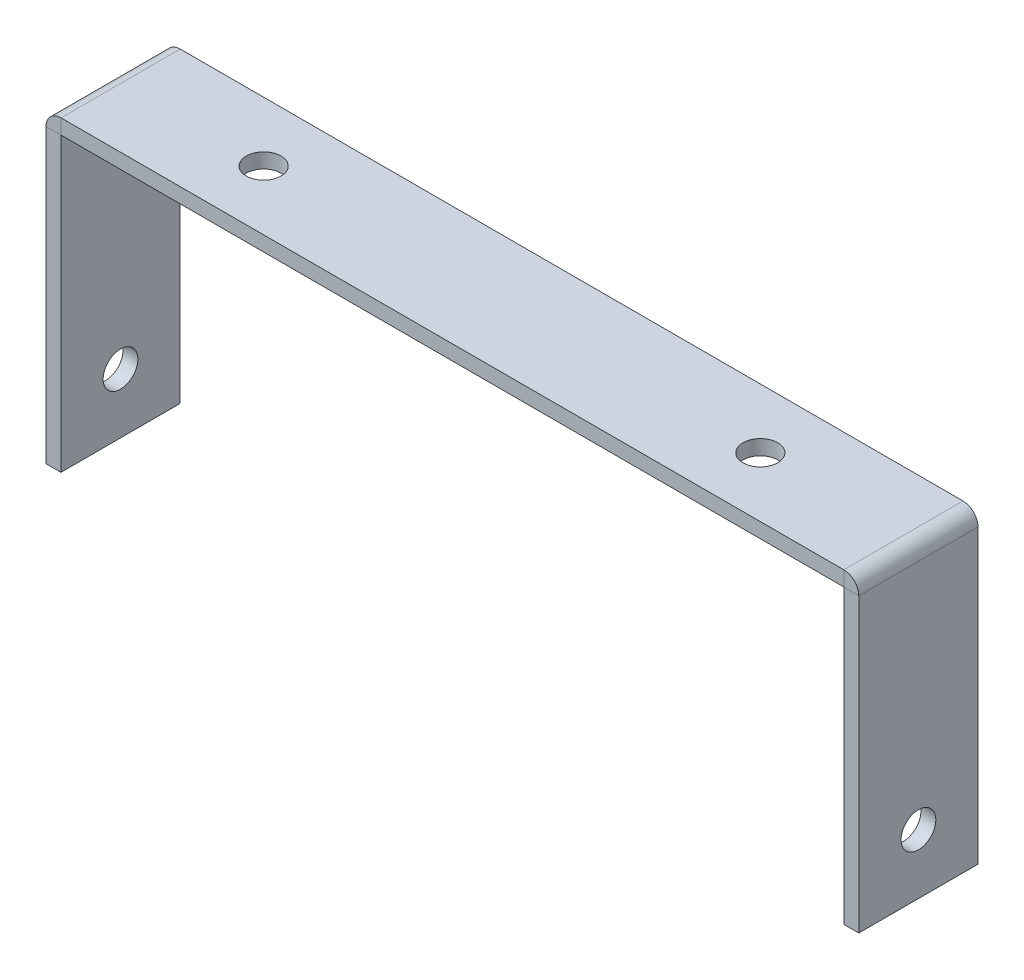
ISO-10303-21;
HEADER;
FILE_DESCRIPTION(('STEP AP214'),'2;1');
FILE_NAME('part.step','',(''),(''),'','','');
FILE_SCHEMA(('AUTOMOTIVE_DESIGN { 1 0 10303 214 1 1 1 1 }'));
ENDSEC;
DATA;
#1=APPLICATION_CONTEXT('core data for automotive mechanical design processes');
#2=APPLICATION_PROTOCOL_DEFINITION('international standard','automotive_design',2000,#1);
#3=PRODUCT_CONTEXT('',#1,'mechanical');
#4=PRODUCT('Part','Part','',(#3));
#5=PRODUCT_RELATED_PRODUCT_CATEGORY('part','',(#4));
#6=PRODUCT_DEFINITION_FORMATION('','',#4);
#7=PRODUCT_DEFINITION_CONTEXT('part definition',#1,'design');
#8=PRODUCT_DEFINITION('design','',#6,#7);
#9=PRODUCT_DEFINITION_SHAPE('','',#8);
#10=(LENGTH_UNIT() NAMED_UNIT(*) SI_UNIT(.MILLI.,.METRE.));
#11=(NAMED_UNIT(*) PLANE_ANGLE_UNIT() SI_UNIT($,.RADIAN.));
#12=(NAMED_UNIT(*) SI_UNIT($,.STERADIAN.) SOLID_ANGLE_UNIT());
#13=UNCERTAINTY_MEASURE_WITH_UNIT(LENGTH_MEASURE(1.E-05),#10,'distance_accuracy_value','');
#14=(GEOMETRIC_REPRESENTATION_CONTEXT(3) GLOBAL_UNCERTAINTY_ASSIGNED_CONTEXT((#13)) GLOBAL_UNIT_ASSIGNED_CONTEXT((#10,
#11,#12)) REPRESENTATION_CONTEXT('',''));
#15=CARTESIAN_POINT('',(0.,0.,0.));
#16=DIRECTION('',(0.,0.,1.));
#17=DIRECTION('',(1.,0.,0.));
#18=AXIS2_PLACEMENT_3D('',#15,#16,#17);
#19=CARTESIAN_POINT('',(70.,0.,-12.));
#20=DIRECTION('',(0.,-1.,0.));
#21=DIRECTION('',(0.,0.,-1.));
#22=AXIS2_PLACEMENT_3D('',#19,#20,#21);
#23=PLANE('',#22);
#24=CARTESIAN_POINT('',(25.,0.,-6.));
#25=DIRECTION('',(0.,1.,0.));
#26=DIRECTION('',(0.,0.,1.));
#27=AXIS2_PLACEMENT_3D('',#24,#25,#26);
#28=CIRCLE('',#27,1.75);
#29=CARTESIAN_POINT('',(25.,0.,-4.25));
#30=VERTEX_POINT('',#29);
#31=EDGE_CURVE('E234',#30,#30,#28,.T.);
#32=ORIENTED_EDGE('',*,*,#31,.T.);
#33=EDGE_LOOP('',(#32));
#34=FACE_BOUND('',#33,.T.);
#35=CARTESIAN_POINT('',(-25.,0.,-6.));
#36=DIRECTION('',(0.,1.,0.));
#37=DIRECTION('',(0.,0.,-1.));
#38=AXIS2_PLACEMENT_3D('',#35,#36,#37);
#39=CIRCLE('',#38,1.75);
#40=CARTESIAN_POINT('',(-25.,0.,-7.75));
#41=VERTEX_POINT('',#40);
#42=EDGE_CURVE('E228',#41,#41,#39,.T.);
#43=ORIENTED_EDGE('',*,*,#42,.T.);
#44=EDGE_LOOP('',(#43));
#45=FACE_BOUND('',#44,.T.);
#46=DIRECTION('',(1.,0.,0.));
#47=VECTOR('',#46,1.);
#48=CARTESIAN_POINT('',(-70.,0.,0.));
#49=LINE('',#48,#47);
#50=CARTESIAN_POINT('',(-39.4030973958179,0.,0.));
#51=VERTEX_POINT('',#50);
#52=CARTESIAN_POINT('',(39.4030973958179,2.75818942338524E-08,0.));
#53=VERTEX_POINT('',#52);
#54=EDGE_CURVE('E57',#51,#53,#49,.T.);
#55=ORIENTED_EDGE('',*,*,#54,.F.);
#56=DIRECTION('',(0.,0.,-1.));
#57=VECTOR('',#56,1.);
#58=CARTESIAN_POINT('',(-39.4030973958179,0.,-12.));
#59=LINE('',#58,#57);
#60=CARTESIAN_POINT('',(-39.4030973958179,0.,-12.));
#61=VERTEX_POINT('',#60);
#62=EDGE_CURVE('E49',#51,#61,#59,.T.);
#63=ORIENTED_EDGE('',*,*,#62,.T.);
#64=DIRECTION('',(-1.,0.,0.));
#65=VECTOR('',#64,1.);
#66=CARTESIAN_POINT('',(-70.,0.,-12.));
#67=LINE('',#66,#65);
#68=CARTESIAN_POINT('',(39.4030973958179,0.,-12.));
#69=VERTEX_POINT('',#68);
#70=EDGE_CURVE('E65',#69,#61,#67,.T.);
#71=ORIENTED_EDGE('',*,*,#70,.F.);
#72=DIRECTION('',(0.,0.,-1.));
#73=VECTOR('',#72,1.);
#74=CARTESIAN_POINT('',(39.4030973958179,0.,-12.));
#75=LINE('',#74,#73);
#76=EDGE_CURVE('E246',#53,#69,#75,.T.);
#77=ORIENTED_EDGE('',*,*,#76,.F.);
#78=EDGE_LOOP('',(#55,#63,#71,#77));
#79=FACE_BOUND('',#78,.T.);
#80=ADVANCED_FACE('F40',(#34,#45,#79),#23,.T.);
#81=CARTESIAN_POINT('',(-70.,1.5,0.));
#82=DIRECTION('',(0.,0.,-1.));
#83=DIRECTION('',(-1.,0.,0.));
#84=AXIS2_PLACEMENT_3D('',#81,#82,#83);
#85=PLANE('',#84);
#86=DIRECTION('',(0.,1.,0.));
#87=VECTOR('',#86,1.);
#88=CARTESIAN_POINT('',(-39.4030973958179,1.5,0.));
#89=LINE('',#88,#87);
#90=CARTESIAN_POINT('',(-39.4030973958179,1.50000001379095,0.));
#91=VERTEX_POINT('',#90);
#92=EDGE_CURVE('E12',#51,#91,#89,.T.);
#93=ORIENTED_EDGE('',*,*,#92,.F.);
#94=ORIENTED_EDGE('',*,*,#54,.T.);
#95=DIRECTION('',(0.,1.,0.));
#96=VECTOR('',#95,1.);
#97=CARTESIAN_POINT('',(39.4030973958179,1.5,0.));
#98=LINE('',#97,#96);
#99=CARTESIAN_POINT('',(39.4030973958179,1.50000001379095,0.));
#100=VERTEX_POINT('',#99);
#101=EDGE_CURVE('E243',#53,#100,#98,.T.);
#102=ORIENTED_EDGE('',*,*,#101,.T.);
#103=DIRECTION('',(1.,0.,0.));
#104=VECTOR('',#103,1.);
#105=CARTESIAN_POINT('',(-70.,1.5,0.));
#106=LINE('',#105,#104);
#107=EDGE_CURVE('E44',#91,#100,#106,.T.);
#108=ORIENTED_EDGE('',*,*,#107,.F.);
#109=EDGE_LOOP('',(#93,#94,#102,#108));
#110=FACE_BOUND('',#109,.T.);
#111=ADVANCED_FACE('F42',(#110),#85,.F.);
#112=CARTESIAN_POINT('',(-70.,1.5,-12.));
#113=DIRECTION('',(0.,0.,1.));
#114=DIRECTION('',(1.,0.,0.));
#115=AXIS2_PLACEMENT_3D('',#112,#113,#114);
#116=PLANE('',#115);
#117=DIRECTION('',(0.,-1.,0.));
#118=VECTOR('',#117,1.);
#119=CARTESIAN_POINT('',(-39.4030973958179,1.5,-12.));
#120=LINE('',#119,#118);
#121=CARTESIAN_POINT('',(-39.4030973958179,1.5,-12.));
#122=VERTEX_POINT('',#121);
#123=EDGE_CURVE('E253',#122,#61,#120,.T.);
#124=ORIENTED_EDGE('',*,*,#123,.F.);
#125=DIRECTION('',(-1.,0.,0.));
#126=VECTOR('',#125,1.);
#127=CARTESIAN_POINT('',(-70.,1.5,-12.));
#128=LINE('',#127,#126);
#129=CARTESIAN_POINT('',(39.4030973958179,1.50000001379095,-12.));
#130=VERTEX_POINT('',#129);
#131=EDGE_CURVE('E258',#130,#122,#128,.T.);
#132=ORIENTED_EDGE('',*,*,#131,.F.);
#133=DIRECTION('',(0.,-1.,0.));
#134=VECTOR('',#133,1.);
#135=CARTESIAN_POINT('',(39.4030973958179,1.5,-12.));
#136=LINE('',#135,#134);
#137=EDGE_CURVE('E248',#130,#69,#136,.T.);
#138=ORIENTED_EDGE('',*,*,#137,.T.);
#139=ORIENTED_EDGE('',*,*,#70,.T.);
#140=EDGE_LOOP('',(#124,#132,#138,#139));
#141=FACE_BOUND('',#140,.T.);
#142=ADVANCED_FACE('F305',(#141),#116,.F.);
#143=CARTESIAN_POINT('',(70.,1.5,-12.));
#144=DIRECTION('',(0.,-1.,0.));
#145=DIRECTION('',(0.,0.,-1.));
#146=AXIS2_PLACEMENT_3D('',#143,#144,#145);
#147=PLANE('',#146);
#148=DIRECTION('',(0.,0.,-1.));
#149=VECTOR('',#148,1.);
#150=CARTESIAN_POINT('',(-39.4030973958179,1.5,-12.));
#151=LINE('',#150,#149);
#152=EDGE_CURVE('E250',#91,#122,#151,.T.);
#153=ORIENTED_EDGE('',*,*,#152,.F.);
#154=ORIENTED_EDGE('',*,*,#107,.T.);
#155=DIRECTION('',(0.,0.,-1.));
#156=VECTOR('',#155,1.);
#157=CARTESIAN_POINT('',(39.4030973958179,1.5,-12.));
#158=LINE('',#157,#156);
#159=EDGE_CURVE('E240',#100,#130,#158,.T.);
#160=ORIENTED_EDGE('',*,*,#159,.T.);
#161=ORIENTED_EDGE('',*,*,#131,.T.);
#162=EDGE_LOOP('',(#153,#154,#160,#161));
#163=FACE_BOUND('',#162,.T.);
#164=CARTESIAN_POINT('',(-25.,1.5,-6.));
#165=DIRECTION('',(0.,1.,0.));
#166=DIRECTION('',(0.,0.,-1.));
#167=AXIS2_PLACEMENT_3D('',#164,#165,#166);
#168=CIRCLE('',#167,1.75);
#169=CARTESIAN_POINT('',(-25.,1.5,-7.75));
#170=VERTEX_POINT('',#169);
#171=EDGE_CURVE('E231',#170,#170,#168,.T.);
#172=ORIENTED_EDGE('',*,*,#171,.F.);
#173=EDGE_LOOP('',(#172));
#174=FACE_BOUND('',#173,.T.);
#175=CARTESIAN_POINT('',(25.,1.5,-6.));
#176=DIRECTION('',(0.,1.,0.));
#177=DIRECTION('',(0.,0.,1.));
#178=AXIS2_PLACEMENT_3D('',#175,#176,#177);
#179=CIRCLE('',#178,1.75);
#180=CARTESIAN_POINT('',(25.,1.5,-4.25));
#181=VERTEX_POINT('',#180);
#182=EDGE_CURVE('E237',#181,#181,#179,.T.);
#183=ORIENTED_EDGE('',*,*,#182,.F.);
#184=EDGE_LOOP('',(#183));
#185=FACE_BOUND('',#184,.T.);
#186=ADVANCED_FACE('F263',(#163,#174,#185),#147,.F.);
#187=CARTESIAN_POINT('',(25.,1.5,-6.));
#188=DIRECTION('',(0.,-1.,0.));
#189=DIRECTION('',(0.,0.,-1.));
#190=AXIS2_PLACEMENT_3D('',#187,#188,#189);
#191=CYLINDRICAL_SURFACE('',#190,1.75);
#192=ORIENTED_EDGE('',*,*,#182,.T.);
#193=EDGE_LOOP('',(#192));
#194=FACE_BOUND('',#193,.T.);
#195=ORIENTED_EDGE('',*,*,#31,.F.);
#196=EDGE_LOOP('',(#195));
#197=FACE_BOUND('',#196,.T.);
#198=ADVANCED_FACE('F312',(#194,#197),#191,.F.);
#199=CARTESIAN_POINT('',(-25.,1.5,-6.));
#200=DIRECTION('',(0.,-1.,0.));
#201=DIRECTION('',(0.,0.,-1.));
#202=AXIS2_PLACEMENT_3D('',#199,#200,#201);
#203=CYLINDRICAL_SURFACE('',#202,1.75);
#204=ORIENTED_EDGE('',*,*,#171,.T.);
#205=EDGE_LOOP('',(#204));
#206=FACE_BOUND('',#205,.T.);
#207=ORIENTED_EDGE('',*,*,#42,.F.);
#208=EDGE_LOOP('',(#207));
#209=FACE_BOUND('',#208,.T.);
#210=ADVANCED_FACE('F315',(#206,#209),#203,.F.);
#211=CARTESIAN_POINT('',(39.4030973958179,-0.0100000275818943,0.));
#212=DIRECTION('',(0.,0.,1.));
#213=DIRECTION('',(1.,0.,0.));
#214=AXIS2_PLACEMENT_3D('',#211,#212,#213);
#215=PLANE('',#214);
#216=ORIENTED_EDGE('',*,*,#101,.F.);
#217=CARTESIAN_POINT('',(39.4030973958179,-0.01,0.));
#218=DIRECTION('',(0.,0.,-1.));
#219=DIRECTION('',(-1.,0.,0.));
#220=AXIS2_PLACEMENT_3D('',#217,#218,#219);
#221=CIRCLE('',#220,0.0100000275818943);
#222=CARTESIAN_POINT('',(39.4130973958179,-0.00999999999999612,0.));
#223=VERTEX_POINT('',#222);
#224=EDGE_CURVE('E180',#53,#223,#221,.T.);
#225=ORIENTED_EDGE('',*,*,#224,.T.);
#226=DIRECTION('',(1.,0.,0.));
#227=VECTOR('',#226,1.);
#228=CARTESIAN_POINT('',(40.9130973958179,-0.0100000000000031,0.));
#229=LINE('',#228,#227);
#230=CARTESIAN_POINT('',(40.9130973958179,-0.0100000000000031,0.));
#231=VERTEX_POINT('',#230);
#232=EDGE_CURVE('E209',#223,#231,#229,.T.);
#233=ORIENTED_EDGE('',*,*,#232,.T.);
#234=CARTESIAN_POINT('',(39.4030973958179,-0.0100000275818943,0.));
#235=DIRECTION('',(0.,0.,-1.));
#236=DIRECTION('',(-1.,0.,0.));
#237=AXIS2_PLACEMENT_3D('',#234,#235,#236);
#238=CIRCLE('',#237,1.51000004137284);
#239=EDGE_CURVE('E220',#100,#231,#238,.T.);
#240=ORIENTED_EDGE('',*,*,#239,.F.);
#241=EDGE_LOOP('',(#216,#225,#233,#240));
#242=FACE_BOUND('',#241,.T.);
#243=ADVANCED_FACE('F269',(#242),#215,.T.);
#244=CARTESIAN_POINT('',(39.4030973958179,-0.0100000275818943,-12.));
#245=DIRECTION('',(0.,0.,-1.));
#246=DIRECTION('',(-1.,0.,0.));
#247=AXIS2_PLACEMENT_3D('',#244,#245,#246);
#248=PLANE('',#247);
#249=DIRECTION('',(-1.,0.,0.));
#250=VECTOR('',#249,1.);
#251=CARTESIAN_POINT('',(40.9130973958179,-0.0100000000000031,-12.));
#252=LINE('',#251,#250);
#253=CARTESIAN_POINT('',(40.9130974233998,-0.0100000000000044,-12.));
#254=VERTEX_POINT('',#253);
#255=CARTESIAN_POINT('',(39.4130973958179,-0.00999999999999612,-12.));
#256=VERTEX_POINT('',#255);
#257=EDGE_CURVE('E212',#254,#256,#252,.T.);
#258=ORIENTED_EDGE('',*,*,#257,.T.);
#259=CARTESIAN_POINT('',(39.4030973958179,-0.01,-12.));
#260=DIRECTION('',(0.,0.,-1.));
#261=DIRECTION('',(-1.,0.,0.));
#262=AXIS2_PLACEMENT_3D('',#259,#260,#261);
#263=CIRCLE('',#262,0.0100000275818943);
#264=EDGE_CURVE('E217',#256,#69,#263,.F.);
#265=ORIENTED_EDGE('',*,*,#264,.T.);
#266=ORIENTED_EDGE('',*,*,#137,.F.);
#267=CARTESIAN_POINT('',(39.4030973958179,-0.0100000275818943,-12.));
#268=DIRECTION('',(0.,0.,1.));
#269=DIRECTION('',(1.,0.,0.));
#270=AXIS2_PLACEMENT_3D('',#267,#268,#269);
#271=CIRCLE('',#270,1.51000004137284);
#272=EDGE_CURVE('E225',#254,#130,#271,.T.);
#273=ORIENTED_EDGE('',*,*,#272,.F.);
#274=EDGE_LOOP('',(#258,#265,#266,#273));
#275=FACE_BOUND('',#274,.T.);
#276=ADVANCED_FACE('F280',(#275),#248,.T.);
#277=CARTESIAN_POINT('',(39.4030973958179,-0.01,6.1521673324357));
#278=DIRECTION('',(0.,0.,-1.));
#279=DIRECTION('',(-1.,0.,0.));
#280=AXIS2_PLACEMENT_3D('',#277,#278,#279);
#281=CYLINDRICAL_SURFACE('',#280,1.51000002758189);
#282=ORIENTED_EDGE('',*,*,#272,.T.);
#283=ORIENTED_EDGE('',*,*,#159,.F.);
#284=ORIENTED_EDGE('',*,*,#239,.T.);
#285=DIRECTION('',(0.,0.,-1.));
#286=VECTOR('',#285,1.);
#287=CARTESIAN_POINT('',(40.9130973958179,-0.01000000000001,-12.));
#288=LINE('',#287,#286);
#289=EDGE_CURVE('E177',#231,#254,#288,.T.);
#290=ORIENTED_EDGE('',*,*,#289,.T.);
#291=EDGE_LOOP('',(#282,#283,#284,#290));
#292=FACE_BOUND('',#291,.T.);
#293=ADVANCED_FACE('F290',(#292),#281,.T.);
#294=CARTESIAN_POINT('',(39.4030973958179,-0.01,6.1521673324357));
#295=DIRECTION('',(0.,0.,-1.));
#296=DIRECTION('',(-1.,0.,0.));
#297=AXIS2_PLACEMENT_3D('',#294,#295,#296);
#298=CYLINDRICAL_SURFACE('',#297,0.0100000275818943);
#299=ORIENTED_EDGE('',*,*,#264,.F.);
#300=DIRECTION('',(0.,0.,-1.));
#301=VECTOR('',#300,1.);
#302=CARTESIAN_POINT('',(39.4130973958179,-0.0100000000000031,-12.));
#303=LINE('',#302,#301);
#304=EDGE_CURVE('E184',#223,#256,#303,.T.);
#305=ORIENTED_EDGE('',*,*,#304,.F.);
#306=ORIENTED_EDGE('',*,*,#224,.F.);
#307=ORIENTED_EDGE('',*,*,#76,.T.);
#308=EDGE_LOOP('',(#299,#305,#306,#307));
#309=FACE_BOUND('',#308,.T.);
#310=ADVANCED_FACE('F273',(#309),#298,.F.);
#311=CARTESIAN_POINT('',(40.9130973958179,-23.4130973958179,-6.));
#312=DIRECTION('',(-1.,0.,0.));
#313=DIRECTION('',(0.,0.,-1.));
#314=AXIS2_PLACEMENT_3D('',#311,#312,#313);
#315=CYLINDRICAL_SURFACE('',#314,1.75);
#316=CARTESIAN_POINT('',(40.9130973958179,-23.4130973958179,-6.));
#317=DIRECTION('',(1.,0.,0.));
#318=DIRECTION('',(0.,0.,1.));
#319=AXIS2_PLACEMENT_3D('',#316,#317,#318);
#320=CIRCLE('',#319,1.75);
#321=CARTESIAN_POINT('',(40.9130973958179,-23.4130973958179,-4.25));
#322=VERTEX_POINT('',#321);
#323=EDGE_CURVE('E206',#322,#322,#320,.T.);
#324=ORIENTED_EDGE('',*,*,#323,.T.);
#325=EDGE_LOOP('',(#324));
#326=FACE_BOUND('',#325,.T.);
#327=CARTESIAN_POINT('',(39.4130973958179,-23.4130973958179,-6.));
#328=DIRECTION('',(1.,0.,0.));
#329=DIRECTION('',(0.,0.,1.));
#330=AXIS2_PLACEMENT_3D('',#327,#328,#329);
#331=CIRCLE('',#330,1.75);
#332=CARTESIAN_POINT('',(39.4130973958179,-23.4130973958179,-4.25));
#333=VERTEX_POINT('',#332);
#334=EDGE_CURVE('E187',#333,#333,#331,.T.);
#335=ORIENTED_EDGE('',*,*,#334,.F.);
#336=EDGE_LOOP('',(#335));
#337=FACE_BOUND('',#336,.T.);
#338=ADVANCED_FACE('F297',(#326,#337),#315,.F.);
#339=CARTESIAN_POINT('',(40.9130973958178,-29.4130973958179,0.));
#340=DIRECTION('',(0.,1.,0.));
#341=DIRECTION('',(0.,0.,1.));
#342=AXIS2_PLACEMENT_3D('',#339,#340,#341);
#343=PLANE('',#342);
#344=DIRECTION('',(0.,0.,-1.));
#345=VECTOR('',#344,1.);
#346=CARTESIAN_POINT('',(39.4130973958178,-29.4130973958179,0.));
#347=LINE('',#346,#345);
#348=CARTESIAN_POINT('',(39.4130973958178,-29.4130973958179,0.));
#349=VERTEX_POINT('',#348);
#350=CARTESIAN_POINT('',(39.4130973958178,-29.4130973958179,-12.));
#351=VERTEX_POINT('',#350);
#352=EDGE_CURVE('E203',#349,#351,#347,.T.);
#353=ORIENTED_EDGE('',*,*,#352,.T.);
#354=DIRECTION('',(-1.,0.,0.));
#355=VECTOR('',#354,1.);
#356=CARTESIAN_POINT('',(40.9130973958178,-29.4130973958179,-12.));
#357=LINE('',#356,#355);
#358=CARTESIAN_POINT('',(40.9130973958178,-29.4130973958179,-12.));
#359=VERTEX_POINT('',#358);
#360=EDGE_CURVE('E181',#359,#351,#357,.T.);
#361=ORIENTED_EDGE('',*,*,#360,.F.);
#362=DIRECTION('',(0.,0.,-1.));
#363=VECTOR('',#362,1.);
#364=CARTESIAN_POINT('',(40.9130973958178,-29.4130973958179,0.));
#365=LINE('',#364,#363);
#366=CARTESIAN_POINT('',(40.9130973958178,-29.4130973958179,0.));
#367=VERTEX_POINT('',#366);
#368=EDGE_CURVE('E195',#367,#359,#365,.T.);
#369=ORIENTED_EDGE('',*,*,#368,.F.);
#370=DIRECTION('',(-1.,0.,0.));
#371=VECTOR('',#370,1.);
#372=CARTESIAN_POINT('',(40.9130973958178,-29.4130973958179,0.));
#373=LINE('',#372,#371);
#374=EDGE_CURVE('E200',#367,#349,#373,.T.);
#375=ORIENTED_EDGE('',*,*,#374,.T.);
#376=EDGE_LOOP('',(#353,#361,#369,#375));
#377=FACE_BOUND('',#376,.T.);
#378=ADVANCED_FACE('F353',(#377),#343,.F.);
#379=CARTESIAN_POINT('',(40.9130973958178,-29.4130973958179,-12.));
#380=DIRECTION('',(-1.,0.,0.));
#381=DIRECTION('',(0.,0.,-1.));
#382=AXIS2_PLACEMENT_3D('',#379,#380,#381);
#383=PLANE('',#382);
#384=ORIENTED_EDGE('',*,*,#289,.F.);
#385=DIRECTION('',(0.,-1.,0.));
#386=VECTOR('',#385,1.);
#387=CARTESIAN_POINT('',(40.9130973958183,110.586902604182,0.));
#388=LINE('',#387,#386);
#389=EDGE_CURVE('E198',#231,#367,#388,.T.);
#390=ORIENTED_EDGE('',*,*,#389,.T.);
#391=ORIENTED_EDGE('',*,*,#368,.T.);
#392=DIRECTION('',(0.,1.,0.));
#393=VECTOR('',#392,1.);
#394=CARTESIAN_POINT('',(40.9130973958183,110.586902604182,-12.));
#395=LINE('',#394,#393);
#396=EDGE_CURVE('E192',#359,#254,#395,.T.);
#397=ORIENTED_EDGE('',*,*,#396,.T.);
#398=EDGE_LOOP('',(#384,#390,#391,#397));
#399=FACE_BOUND('',#398,.T.);
#400=ORIENTED_EDGE('',*,*,#323,.F.);
#401=EDGE_LOOP('',(#400));
#402=FACE_BOUND('',#401,.T.);
#403=ADVANCED_FACE('F284',(#399,#402),#383,.F.);
#404=CARTESIAN_POINT('',(40.9130973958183,110.586902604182,0.));
#405=DIRECTION('',(0.,0.,-1.));
#406=DIRECTION('',(0.,1.,0.));
#407=AXIS2_PLACEMENT_3D('',#404,#405,#406);
#408=PLANE('',#407);
#409=ORIENTED_EDGE('',*,*,#232,.F.);
#410=DIRECTION('',(0.,-1.,0.));
#411=VECTOR('',#410,1.);
#412=CARTESIAN_POINT('',(39.4130973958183,110.586902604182,0.));
#413=LINE('',#412,#411);
#414=EDGE_CURVE('E190',#223,#349,#413,.T.);
#415=ORIENTED_EDGE('',*,*,#414,.T.);
#416=ORIENTED_EDGE('',*,*,#374,.F.);
#417=ORIENTED_EDGE('',*,*,#389,.F.);
#418=EDGE_LOOP('',(#409,#415,#416,#417));
#419=FACE_BOUND('',#418,.T.);
#420=ADVANCED_FACE('F375',(#419),#408,.F.);
#421=CARTESIAN_POINT('',(39.4130973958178,-29.4130973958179,-12.));
#422=DIRECTION('',(-1.,0.,0.));
#423=DIRECTION('',(0.,0.,-1.));
#424=AXIS2_PLACEMENT_3D('',#421,#422,#423);
#425=PLANE('',#424);
#426=ORIENTED_EDGE('',*,*,#334,.T.);
#427=EDGE_LOOP('',(#426));
#428=FACE_BOUND('',#427,.T.);
#429=ORIENTED_EDGE('',*,*,#414,.F.);
#430=ORIENTED_EDGE('',*,*,#304,.T.);
#431=DIRECTION('',(0.,1.,0.));
#432=VECTOR('',#431,1.);
#433=CARTESIAN_POINT('',(39.4130973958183,110.586902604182,-12.));
#434=LINE('',#433,#432);
#435=EDGE_CURVE('E178',#351,#256,#434,.T.);
#436=ORIENTED_EDGE('',*,*,#435,.F.);
#437=ORIENTED_EDGE('',*,*,#352,.F.);
#438=EDGE_LOOP('',(#429,#430,#436,#437));
#439=FACE_BOUND('',#438,.T.);
#440=ADVANCED_FACE('F275',(#428,#439),#425,.T.);
#441=CARTESIAN_POINT('',(40.9130973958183,110.586902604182,-12.));
#442=DIRECTION('',(0.,0.,1.));
#443=DIRECTION('',(0.,-1.,0.));
#444=AXIS2_PLACEMENT_3D('',#441,#442,#443);
#445=PLANE('',#444);
#446=ORIENTED_EDGE('',*,*,#257,.F.);
#447=ORIENTED_EDGE('',*,*,#396,.F.);
#448=ORIENTED_EDGE('',*,*,#360,.T.);
#449=ORIENTED_EDGE('',*,*,#435,.T.);
#450=EDGE_LOOP('',(#446,#447,#448,#449));
#451=FACE_BOUND('',#450,.T.);
#452=ADVANCED_FACE('F282',(#451),#445,.F.);
#453=CARTESIAN_POINT('',(-39.4030973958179,-0.0100000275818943,0.));
#454=DIRECTION('',(0.,0.,1.));
#455=DIRECTION('',(1.,0.,0.));
#456=AXIS2_PLACEMENT_3D('',#453,#454,#455);
#457=PLANE('',#456);
#458=DIRECTION('',(-1.,0.,0.));
#459=VECTOR('',#458,1.);
#460=CARTESIAN_POINT('',(-40.9130973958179,-0.01000000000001,0.));
#461=LINE('',#460,#459);
#462=CARTESIAN_POINT('',(-39.4130973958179,-0.00999999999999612,0.));
#463=VERTEX_POINT('',#462);
#464=CARTESIAN_POINT('',(-40.9130973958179,-0.0100000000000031,0.));
#465=VERTEX_POINT('',#464);
#466=EDGE_CURVE('E580',#463,#465,#461,.T.);
#467=ORIENTED_EDGE('',*,*,#466,.F.);
#468=CARTESIAN_POINT('',(-39.4030973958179,-0.01,0.));
#469=DIRECTION('',(0.,0.,1.));
#470=DIRECTION('',(1.,0.,0.));
#471=AXIS2_PLACEMENT_3D('',#468,#469,#470);
#472=CIRCLE('',#471,0.0100000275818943);
#473=EDGE_CURVE('E168',#463,#51,#472,.F.);
#474=ORIENTED_EDGE('',*,*,#473,.T.);
#475=ORIENTED_EDGE('',*,*,#92,.T.);
#476=CARTESIAN_POINT('',(-39.4030973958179,-0.0100000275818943,0.));
#477=DIRECTION('',(0.,0.,-1.));
#478=DIRECTION('',(-1.,0.,0.));
#479=AXIS2_PLACEMENT_3D('',#476,#477,#478);
#480=CIRCLE('',#479,1.51000004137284);
#481=EDGE_CURVE('E167',#465,#91,#480,.T.);
#482=ORIENTED_EDGE('',*,*,#481,.F.);
#483=EDGE_LOOP('',(#467,#474,#475,#482));
#484=FACE_BOUND('',#483,.T.);
#485=ADVANCED_FACE('F405',(#484),#457,.T.);
#486=CARTESIAN_POINT('',(-39.4030973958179,-0.0100000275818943,-12.));
#487=DIRECTION('',(0.,0.,-1.));
#488=DIRECTION('',(-1.,0.,0.));
#489=AXIS2_PLACEMENT_3D('',#486,#487,#488);
#490=PLANE('',#489);
#491=ORIENTED_EDGE('',*,*,#123,.T.);
#492=CARTESIAN_POINT('',(-39.4030973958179,-0.01,-12.));
#493=DIRECTION('',(0.,0.,1.));
#494=DIRECTION('',(1.,0.,0.));
#495=AXIS2_PLACEMENT_3D('',#492,#493,#494);
#496=CIRCLE('',#495,0.0100000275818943);
#497=CARTESIAN_POINT('',(-39.4130973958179,-0.00999999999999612,-12.));
#498=VERTEX_POINT('',#497);
#499=EDGE_CURVE('E165',#61,#498,#496,.T.);
#500=ORIENTED_EDGE('',*,*,#499,.T.);
#501=DIRECTION('',(1.,0.,0.));
#502=VECTOR('',#501,1.);
#503=CARTESIAN_POINT('',(-40.9130973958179,-0.01000000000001,-12.));
#504=LINE('',#503,#502);
#505=CARTESIAN_POINT('',(-40.9130974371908,-0.0100000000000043,-12.));
#506=VERTEX_POINT('',#505);
#507=EDGE_CURVE('E140',#506,#498,#504,.T.);
#508=ORIENTED_EDGE('',*,*,#507,.F.);
#509=CARTESIAN_POINT('',(-39.4030973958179,-0.0100000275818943,-12.));
#510=DIRECTION('',(0.,0.,1.));
#511=DIRECTION('',(1.,0.,0.));
#512=AXIS2_PLACEMENT_3D('',#509,#510,#511);
#513=CIRCLE('',#512,1.51000004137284);
#514=EDGE_CURVE('E174',#122,#506,#513,.T.);
#515=ORIENTED_EDGE('',*,*,#514,.F.);
#516=EDGE_LOOP('',(#491,#500,#508,#515));
#517=FACE_BOUND('',#516,.T.);
#518=ADVANCED_FACE('F415',(#517),#490,.T.);
#519=CARTESIAN_POINT('',(-39.4030973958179,-0.01,-18.1521673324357));
#520=DIRECTION('',(0.,0.,1.));
#521=DIRECTION('',(1.,0.,0.));
#522=AXIS2_PLACEMENT_3D('',#519,#520,#521);
#523=CYLINDRICAL_SURFACE('',#522,1.51000002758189);
#524=ORIENTED_EDGE('',*,*,#514,.T.);
#525=DIRECTION('',(0.,0.,-1.));
#526=VECTOR('',#525,1.);
#527=CARTESIAN_POINT('',(-40.9130973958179,-0.0100000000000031,-12.));
#528=LINE('',#527,#526);
#529=EDGE_CURVE('E590',#465,#506,#528,.T.);
#530=ORIENTED_EDGE('',*,*,#529,.F.);
#531=ORIENTED_EDGE('',*,*,#481,.T.);
#532=ORIENTED_EDGE('',*,*,#152,.T.);
#533=EDGE_LOOP('',(#524,#530,#531,#532));
#534=FACE_BOUND('',#533,.T.);
#535=ADVANCED_FACE('F426',(#534),#523,.T.);
#536=CARTESIAN_POINT('',(-39.4030973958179,-0.01,-18.1521673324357));
#537=DIRECTION('',(0.,0.,1.));
#538=DIRECTION('',(1.,0.,0.));
#539=AXIS2_PLACEMENT_3D('',#536,#537,#538);
#540=CYLINDRICAL_SURFACE('',#539,0.0100000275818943);
#541=ORIENTED_EDGE('',*,*,#499,.F.);
#542=ORIENTED_EDGE('',*,*,#62,.F.);
#543=ORIENTED_EDGE('',*,*,#473,.F.);
#544=DIRECTION('',(0.,0.,-1.));
#545=VECTOR('',#544,1.);
#546=CARTESIAN_POINT('',(-39.4130973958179,-0.00999999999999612,-12.));
#547=LINE('',#546,#545);
#548=EDGE_CURVE('E159',#463,#498,#547,.T.);
#549=ORIENTED_EDGE('',*,*,#548,.T.);
#550=EDGE_LOOP('',(#541,#542,#543,#549));
#551=FACE_BOUND('',#550,.T.);
#552=ADVANCED_FACE('F437',(#551),#540,.F.);
#553=CARTESIAN_POINT('',(-40.9130973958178,-29.4130973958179,0.));
#554=DIRECTION('',(0.,1.,0.));
#555=DIRECTION('',(0.,0.,-1.));
#556=AXIS2_PLACEMENT_3D('',#553,#554,#555);
#557=PLANE('',#556);
#558=DIRECTION('',(0.,0.,1.));
#559=VECTOR('',#558,1.);
#560=CARTESIAN_POINT('',(-39.4130973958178,-29.4130973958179,0.));
#561=LINE('',#560,#559);
#562=CARTESIAN_POINT('',(-39.4130973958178,-29.4130973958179,-12.));
#563=VERTEX_POINT('',#562);
#564=CARTESIAN_POINT('',(-39.4130973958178,-29.4130973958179,0.));
#565=VERTEX_POINT('',#564);
#566=EDGE_CURVE('E150',#563,#565,#561,.T.);
#567=ORIENTED_EDGE('',*,*,#566,.T.);
#568=DIRECTION('',(1.,0.,0.));
#569=VECTOR('',#568,1.);
#570=CARTESIAN_POINT('',(-40.9130973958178,-29.4130973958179,0.));
#571=LINE('',#570,#569);
#572=CARTESIAN_POINT('',(-40.9130973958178,-29.4130973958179,0.));
#573=VERTEX_POINT('',#572);
#574=EDGE_CURVE('E171',#573,#565,#571,.T.);
#575=ORIENTED_EDGE('',*,*,#574,.F.);
#576=DIRECTION('',(0.,0.,1.));
#577=VECTOR('',#576,1.);
#578=CARTESIAN_POINT('',(-40.9130973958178,-29.4130973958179,0.));
#579=LINE('',#578,#577);
#580=CARTESIAN_POINT('',(-40.9130973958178,-29.4130973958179,-12.));
#581=VERTEX_POINT('',#580);
#582=EDGE_CURVE('E152',#581,#573,#579,.T.);
#583=ORIENTED_EDGE('',*,*,#582,.F.);
#584=DIRECTION('',(1.,0.,0.));
#585=VECTOR('',#584,1.);
#586=CARTESIAN_POINT('',(-40.9130973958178,-29.4130973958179,-12.));
#587=LINE('',#586,#585);
#588=EDGE_CURVE('E137',#581,#563,#587,.T.);
#589=ORIENTED_EDGE('',*,*,#588,.T.);
#590=EDGE_LOOP('',(#567,#575,#583,#589));
#591=FACE_BOUND('',#590,.T.);
#592=ADVANCED_FACE('F148',(#591),#557,.F.);
#593=CARTESIAN_POINT('',(-40.9130973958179,-23.4130973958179,-6.));
#594=DIRECTION('',(1.,0.,0.));
#595=DIRECTION('',(0.,0.,-1.));
#596=AXIS2_PLACEMENT_3D('',#593,#594,#595);
#597=CYLINDRICAL_SURFACE('',#596,1.75);
#598=CARTESIAN_POINT('',(-40.9130973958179,-23.4130973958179,-6.));
#599=DIRECTION('',(-1.,0.,0.));
#600=DIRECTION('',(0.,0.,-1.));
#601=AXIS2_PLACEMENT_3D('',#598,#599,#600);
#602=CIRCLE('',#601,1.75);
#603=CARTESIAN_POINT('',(-40.9130973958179,-23.4130973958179,-7.75));
#604=VERTEX_POINT('',#603);
#605=EDGE_CURVE('E153',#604,#604,#602,.T.);
#606=ORIENTED_EDGE('',*,*,#605,.T.);
#607=EDGE_LOOP('',(#606));
#608=FACE_BOUND('',#607,.T.);
#609=CARTESIAN_POINT('',(-39.4130973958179,-23.4130973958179,-6.));
#610=DIRECTION('',(-1.,0.,0.));
#611=DIRECTION('',(0.,0.,-1.));
#612=AXIS2_PLACEMENT_3D('',#609,#610,#611);
#613=CIRCLE('',#612,1.75);
#614=CARTESIAN_POINT('',(-39.4130973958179,-23.4130973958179,-7.75));
#615=VERTEX_POINT('',#614);
#616=EDGE_CURVE('E145',#615,#615,#613,.T.);
#617=ORIENTED_EDGE('',*,*,#616,.F.);
#618=EDGE_LOOP('',(#617));
#619=FACE_BOUND('',#618,.T.);
#620=ADVANCED_FACE('F458',(#608,#619),#597,.F.);
#621=CARTESIAN_POINT('',(-40.9130973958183,110.586902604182,-12.));
#622=DIRECTION('',(1.,0.,0.));
#623=DIRECTION('',(0.,0.,-1.));
#624=AXIS2_PLACEMENT_3D('',#621,#622,#623);
#625=PLANE('',#624);
#626=ORIENTED_EDGE('',*,*,#605,.F.);
#627=EDGE_LOOP('',(#626));
#628=FACE_BOUND('',#627,.T.);
#629=DIRECTION('',(0.,1.,0.));
#630=VECTOR('',#629,1.);
#631=CARTESIAN_POINT('',(-40.9130973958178,-29.4130973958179,0.));
#632=LINE('',#631,#630);
#633=EDGE_CURVE('E593',#573,#465,#632,.T.);
#634=ORIENTED_EDGE('',*,*,#633,.T.);
#635=ORIENTED_EDGE('',*,*,#529,.T.);
#636=DIRECTION('',(0.,-1.,0.));
#637=VECTOR('',#636,1.);
#638=CARTESIAN_POINT('',(-40.9130973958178,-29.4130973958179,-12.));
#639=LINE('',#638,#637);
#640=EDGE_CURVE('E592',#506,#581,#639,.T.);
#641=ORIENTED_EDGE('',*,*,#640,.T.);
#642=ORIENTED_EDGE('',*,*,#582,.T.);
#643=EDGE_LOOP('',(#634,#635,#641,#642));
#644=FACE_BOUND('',#643,.T.);
#645=ADVANCED_FACE('F468',(#628,#644),#625,.F.);
#646=CARTESIAN_POINT('',(-40.9130973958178,-29.4130973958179,-12.));
#647=DIRECTION('',(0.,0.,1.));
#648=DIRECTION('',(0.,1.,0.));
#649=AXIS2_PLACEMENT_3D('',#646,#647,#648);
#650=PLANE('',#649);
#651=ORIENTED_EDGE('',*,*,#640,.F.);
#652=ORIENTED_EDGE('',*,*,#507,.T.);
#653=DIRECTION('',(0.,-1.,0.));
#654=VECTOR('',#653,1.);
#655=CARTESIAN_POINT('',(-39.4130973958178,-29.4130973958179,-12.));
#656=LINE('',#655,#654);
#657=EDGE_CURVE('E134',#498,#563,#656,.T.);
#658=ORIENTED_EDGE('',*,*,#657,.T.);
#659=ORIENTED_EDGE('',*,*,#588,.F.);
#660=EDGE_LOOP('',(#651,#652,#658,#659));
#661=FACE_BOUND('',#660,.T.);
#662=ADVANCED_FACE('F136',(#661),#650,.F.);
#663=CARTESIAN_POINT('',(-39.4130973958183,110.586902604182,-12.));
#664=DIRECTION('',(1.,0.,0.));
#665=DIRECTION('',(0.,0.,-1.));
#666=AXIS2_PLACEMENT_3D('',#663,#664,#665);
#667=PLANE('',#666);
#668=ORIENTED_EDGE('',*,*,#548,.F.);
#669=DIRECTION('',(0.,1.,0.));
#670=VECTOR('',#669,1.);
#671=CARTESIAN_POINT('',(-39.4130973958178,-29.4130973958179,0.));
#672=LINE('',#671,#670);
#673=EDGE_CURVE('E158',#565,#463,#672,.T.);
#674=ORIENTED_EDGE('',*,*,#673,.F.);
#675=ORIENTED_EDGE('',*,*,#566,.F.);
#676=ORIENTED_EDGE('',*,*,#657,.F.);
#677=EDGE_LOOP('',(#668,#674,#675,#676));
#678=FACE_BOUND('',#677,.T.);
#679=ORIENTED_EDGE('',*,*,#616,.T.);
#680=EDGE_LOOP('',(#679));
#681=FACE_BOUND('',#680,.T.);
#682=ADVANCED_FACE('F156',(#678,#681),#667,.T.);
#683=CARTESIAN_POINT('',(-40.9130973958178,-29.4130973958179,0.));
#684=DIRECTION('',(0.,0.,-1.));
#685=DIRECTION('',(0.,-1.,0.));
#686=AXIS2_PLACEMENT_3D('',#683,#684,#685);
#687=PLANE('',#686);
#688=ORIENTED_EDGE('',*,*,#673,.T.);
#689=ORIENTED_EDGE('',*,*,#466,.T.);
#690=ORIENTED_EDGE('',*,*,#633,.F.);
#691=ORIENTED_EDGE('',*,*,#574,.T.);
#692=EDGE_LOOP('',(#688,#689,#690,#691));
#693=FACE_BOUND('',#692,.T.);
#694=ADVANCED_FACE('F498',(#693),#687,.F.);
#695=CLOSED_SHELL('',(#80,#111,#142,#186,#198,#210,#243,#276,#293,#310,#338,#378,#403,#420,#440,
#452,#485,#518,#535,#552,#592,#620,#645,#662,#682,#694));
#696=MANIFOLD_SOLID_BREP('B2',#695);
#697=ADVANCED_BREP_SHAPE_REPRESENTATION('',(#18,#696),#14);
#698=SHAPE_DEFINITION_REPRESENTATION(#9,#697);
ENDSEC;
END-ISO-10303-21;
